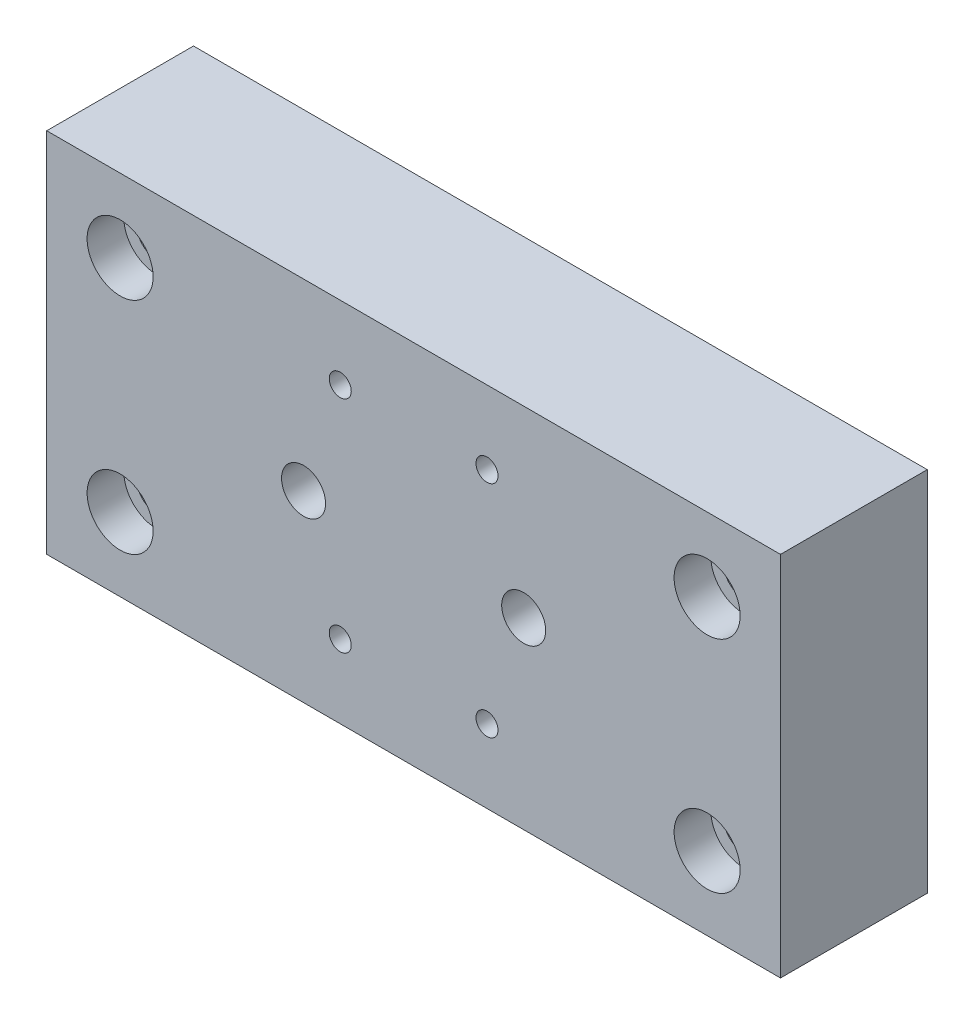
ISO-10303-21;
HEADER;
FILE_DESCRIPTION(('STEP AP214'),'2;1');
FILE_NAME('part.step','',(''),(''),'','','');
FILE_SCHEMA(('AUTOMOTIVE_DESIGN { 1 0 10303 214 1 1 1 1 }'));
ENDSEC;
DATA;
#1=APPLICATION_CONTEXT('core data for automotive mechanical design processes');
#2=APPLICATION_PROTOCOL_DEFINITION('international standard','automotive_design',2000,#1);
#3=PRODUCT_CONTEXT('',#1,'mechanical');
#4=PRODUCT('Part','Part','',(#3));
#5=PRODUCT_RELATED_PRODUCT_CATEGORY('part','',(#4));
#6=PRODUCT_DEFINITION_FORMATION('','',#4);
#7=PRODUCT_DEFINITION_CONTEXT('part definition',#1,'design');
#8=PRODUCT_DEFINITION('design','',#6,#7);
#9=PRODUCT_DEFINITION_SHAPE('','',#8);
#10=(LENGTH_UNIT() NAMED_UNIT(*) SI_UNIT(.MILLI.,.METRE.));
#11=(NAMED_UNIT(*) PLANE_ANGLE_UNIT() SI_UNIT($,.RADIAN.));
#12=(NAMED_UNIT(*) SI_UNIT($,.STERADIAN.) SOLID_ANGLE_UNIT());
#13=UNCERTAINTY_MEASURE_WITH_UNIT(LENGTH_MEASURE(1.E-05),#10,'distance_accuracy_value','');
#14=(GEOMETRIC_REPRESENTATION_CONTEXT(3) GLOBAL_UNCERTAINTY_ASSIGNED_CONTEXT((#13)) GLOBAL_UNIT_ASSIGNED_CONTEXT((#10,
#11,#12)) REPRESENTATION_CONTEXT('',''));
#15=CARTESIAN_POINT('',(0.,0.,0.));
#16=DIRECTION('',(0.,0.,1.));
#17=DIRECTION('',(1.,0.,0.));
#18=AXIS2_PLACEMENT_3D('',#15,#16,#17);
#19=CARTESIAN_POINT('',(-100.,50.,40.));
#20=DIRECTION('',(1.,0.,0.));
#21=DIRECTION('',(0.,0.,-1.));
#22=AXIS2_PLACEMENT_3D('',#19,#20,#21);
#23=PLANE('',#22);
#24=DIRECTION('',(0.,-1.,0.));
#25=VECTOR('',#24,1.);
#26=CARTESIAN_POINT('',(-100.,50.,0.));
#27=LINE('',#26,#25);
#28=CARTESIAN_POINT('',(-100.,50.,0.));
#29=VERTEX_POINT('',#28);
#30=CARTESIAN_POINT('',(-100.,-50.,0.));
#31=VERTEX_POINT('',#30);
#32=EDGE_CURVE('E508',#29,#31,#27,.T.);
#33=ORIENTED_EDGE('',*,*,#32,.T.);
#34=DIRECTION('',(0.,0.,-1.));
#35=VECTOR('',#34,1.);
#36=CARTESIAN_POINT('',(-100.,-50.,40.));
#37=LINE('',#36,#35);
#38=CARTESIAN_POINT('',(-100.,-50.,40.));
#39=VERTEX_POINT('',#38);
#40=EDGE_CURVE('E11',#39,#31,#37,.T.);
#41=ORIENTED_EDGE('',*,*,#40,.F.);
#42=DIRECTION('',(0.,-1.,0.));
#43=VECTOR('',#42,1.);
#44=CARTESIAN_POINT('',(-100.,50.,40.));
#45=LINE('',#44,#43);
#46=CARTESIAN_POINT('',(-100.,50.,40.));
#47=VERTEX_POINT('',#46);
#48=EDGE_CURVE('E517',#47,#39,#45,.T.);
#49=ORIENTED_EDGE('',*,*,#48,.F.);
#50=DIRECTION('',(0.,0.,-1.));
#51=VECTOR('',#50,1.);
#52=CARTESIAN_POINT('',(-100.,50.,40.));
#53=LINE('',#52,#51);
#54=EDGE_CURVE('E523',#47,#29,#53,.T.);
#55=ORIENTED_EDGE('',*,*,#54,.T.);
#56=EDGE_LOOP('',(#33,#41,#49,#55));
#57=FACE_BOUND('',#56,.T.);
#58=ADVANCED_FACE('F348',(#57),#23,.F.);
#59=CARTESIAN_POINT('',(-100.,-50.,40.));
#60=DIRECTION('',(0.,1.,0.));
#61=DIRECTION('',(0.,0.,1.));
#62=AXIS2_PLACEMENT_3D('',#59,#60,#61);
#63=PLANE('',#62);
#64=DIRECTION('',(1.,0.,0.));
#65=VECTOR('',#64,1.);
#66=CARTESIAN_POINT('',(-100.,-50.,0.));
#67=LINE('',#66,#65);
#68=CARTESIAN_POINT('',(100.,-50.,0.));
#69=VERTEX_POINT('',#68);
#70=EDGE_CURVE('E511',#31,#69,#67,.T.);
#71=ORIENTED_EDGE('',*,*,#70,.T.);
#72=DIRECTION('',(0.,0.,-1.));
#73=VECTOR('',#72,1.);
#74=CARTESIAN_POINT('',(100.,-50.,40.));
#75=LINE('',#74,#73);
#76=CARTESIAN_POINT('',(100.,-50.,40.));
#77=VERTEX_POINT('',#76);
#78=EDGE_CURVE('E355',#77,#69,#75,.T.);
#79=ORIENTED_EDGE('',*,*,#78,.F.);
#80=DIRECTION('',(1.,0.,0.));
#81=VECTOR('',#80,1.);
#82=CARTESIAN_POINT('',(-100.,-50.,40.));
#83=LINE('',#82,#81);
#84=EDGE_CURVE('E519',#39,#77,#83,.T.);
#85=ORIENTED_EDGE('',*,*,#84,.F.);
#86=ORIENTED_EDGE('',*,*,#40,.T.);
#87=EDGE_LOOP('',(#71,#79,#85,#86));
#88=FACE_BOUND('',#87,.T.);
#89=ADVANCED_FACE('F544',(#88),#63,.F.);
#90=CARTESIAN_POINT('',(100.,50.,40.));
#91=DIRECTION('',(-1.,0.,0.));
#92=DIRECTION('',(0.,-1.,0.));
#93=AXIS2_PLACEMENT_3D('',#90,#91,#92);
#94=PLANE('',#93);
#95=DIRECTION('',(0.,1.,0.));
#96=VECTOR('',#95,1.);
#97=CARTESIAN_POINT('',(100.,50.,0.));
#98=LINE('',#97,#96);
#99=CARTESIAN_POINT('',(100.,50.,0.));
#100=VERTEX_POINT('',#99);
#101=EDGE_CURVE('E513',#69,#100,#98,.T.);
#102=ORIENTED_EDGE('',*,*,#101,.T.);
#103=DIRECTION('',(0.,0.,-1.));
#104=VECTOR('',#103,1.);
#105=CARTESIAN_POINT('',(100.,50.,40.));
#106=LINE('',#105,#104);
#107=CARTESIAN_POINT('',(100.,50.,40.));
#108=VERTEX_POINT('',#107);
#109=EDGE_CURVE('E526',#108,#100,#106,.T.);
#110=ORIENTED_EDGE('',*,*,#109,.F.);
#111=DIRECTION('',(0.,1.,0.));
#112=VECTOR('',#111,1.);
#113=CARTESIAN_POINT('',(100.,50.,40.));
#114=LINE('',#113,#112);
#115=EDGE_CURVE('E367',#77,#108,#114,.T.);
#116=ORIENTED_EDGE('',*,*,#115,.F.);
#117=ORIENTED_EDGE('',*,*,#78,.T.);
#118=EDGE_LOOP('',(#102,#110,#116,#117));
#119=FACE_BOUND('',#118,.T.);
#120=ADVANCED_FACE('F532',(#119),#94,.F.);
#121=CARTESIAN_POINT('',(-100.,50.,40.));
#122=DIRECTION('',(0.,-1.,0.));
#123=DIRECTION('',(1.,0.,0.));
#124=AXIS2_PLACEMENT_3D('',#121,#122,#123);
#125=PLANE('',#124);
#126=DIRECTION('',(-1.,0.,0.));
#127=VECTOR('',#126,1.);
#128=CARTESIAN_POINT('',(-100.,50.,0.));
#129=LINE('',#128,#127);
#130=EDGE_CURVE('E515',#100,#29,#129,.T.);
#131=ORIENTED_EDGE('',*,*,#130,.T.);
#132=ORIENTED_EDGE('',*,*,#54,.F.);
#133=DIRECTION('',(-1.,0.,0.));
#134=VECTOR('',#133,1.);
#135=CARTESIAN_POINT('',(-100.,50.,40.));
#136=LINE('',#135,#134);
#137=EDGE_CURVE('E362',#108,#47,#136,.T.);
#138=ORIENTED_EDGE('',*,*,#137,.F.);
#139=ORIENTED_EDGE('',*,*,#109,.T.);
#140=EDGE_LOOP('',(#131,#132,#138,#139));
#141=FACE_BOUND('',#140,.T.);
#142=ADVANCED_FACE('F539',(#141),#125,.F.);
#143=CARTESIAN_POINT('',(-100.,-50.,40.));
#144=DIRECTION('',(0.,0.,1.));
#145=DIRECTION('',(1.,0.,0.));
#146=AXIS2_PLACEMENT_3D('',#143,#144,#145);
#147=PLANE('',#146);
#148=CARTESIAN_POINT('',(-30.,0.,40.));
#149=DIRECTION('',(0.,0.,1.));
#150=DIRECTION('',(1.,0.,0.));
#151=AXIS2_PLACEMENT_3D('',#148,#149,#150);
#152=CIRCLE('',#151,6.00000000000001);
#153=CARTESIAN_POINT('',(-24.,0.,40.));
#154=VERTEX_POINT('',#153);
#155=EDGE_CURVE('E680',#154,#154,#152,.T.);
#156=ORIENTED_EDGE('',*,*,#155,.F.);
#157=EDGE_LOOP('',(#156));
#158=FACE_BOUND('',#157,.T.);
#159=CARTESIAN_POINT('',(30.,0.,40.));
#160=DIRECTION('',(0.,0.,1.));
#161=DIRECTION('',(1.,0.,0.));
#162=AXIS2_PLACEMENT_3D('',#159,#160,#161);
#163=CIRCLE('',#162,6.00000000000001);
#164=CARTESIAN_POINT('',(36.,0.,40.));
#165=VERTEX_POINT('',#164);
#166=EDGE_CURVE('E415',#165,#165,#163,.T.);
#167=ORIENTED_EDGE('',*,*,#166,.F.);
#168=EDGE_LOOP('',(#167));
#169=FACE_BOUND('',#168,.T.);
#170=CARTESIAN_POINT('',(-20.,30.,40.));
#171=DIRECTION('',(0.,0.,1.));
#172=DIRECTION('',(1.,0.,0.));
#173=AXIS2_PLACEMENT_3D('',#170,#171,#172);
#174=CIRCLE('',#173,3.);
#175=CARTESIAN_POINT('',(-17.,30.,40.));
#176=VERTEX_POINT('',#175);
#177=EDGE_CURVE('E421',#176,#176,#174,.T.);
#178=ORIENTED_EDGE('',*,*,#177,.F.);
#179=EDGE_LOOP('',(#178));
#180=FACE_BOUND('',#179,.T.);
#181=CARTESIAN_POINT('',(20.,30.,40.));
#182=DIRECTION('',(0.,0.,1.));
#183=DIRECTION('',(1.,0.,0.));
#184=AXIS2_PLACEMENT_3D('',#181,#182,#183);
#185=CIRCLE('',#184,3.);
#186=CARTESIAN_POINT('',(23.,30.,40.));
#187=VERTEX_POINT('',#186);
#188=EDGE_CURVE('E433',#187,#187,#185,.T.);
#189=ORIENTED_EDGE('',*,*,#188,.F.);
#190=EDGE_LOOP('',(#189));
#191=FACE_BOUND('',#190,.T.);
#192=CARTESIAN_POINT('',(-20.,-30.,40.));
#193=DIRECTION('',(0.,0.,1.));
#194=DIRECTION('',(1.,0.,0.));
#195=AXIS2_PLACEMENT_3D('',#192,#193,#194);
#196=CIRCLE('',#195,3.);
#197=CARTESIAN_POINT('',(-17.,-30.,40.));
#198=VERTEX_POINT('',#197);
#199=EDGE_CURVE('E445',#198,#198,#196,.T.);
#200=ORIENTED_EDGE('',*,*,#199,.F.);
#201=EDGE_LOOP('',(#200));
#202=FACE_BOUND('',#201,.T.);
#203=CARTESIAN_POINT('',(20.,-30.,40.));
#204=DIRECTION('',(0.,0.,1.));
#205=DIRECTION('',(1.,0.,0.));
#206=AXIS2_PLACEMENT_3D('',#203,#204,#205);
#207=CIRCLE('',#206,3.);
#208=CARTESIAN_POINT('',(23.,-30.,40.));
#209=VERTEX_POINT('',#208);
#210=EDGE_CURVE('E457',#209,#209,#207,.T.);
#211=ORIENTED_EDGE('',*,*,#210,.F.);
#212=EDGE_LOOP('',(#211));
#213=FACE_BOUND('',#212,.T.);
#214=CARTESIAN_POINT('',(-80.,30.,40.));
#215=DIRECTION('',(0.,0.,1.));
#216=DIRECTION('',(1.,0.,0.));
#217=AXIS2_PLACEMENT_3D('',#214,#215,#216);
#218=CIRCLE('',#217,8.99999999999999);
#219=CARTESIAN_POINT('',(-71.,30.,40.));
#220=VERTEX_POINT('',#219);
#221=EDGE_CURVE('E466',#220,#220,#218,.T.);
#222=ORIENTED_EDGE('',*,*,#221,.F.);
#223=EDGE_LOOP('',(#222));
#224=FACE_BOUND('',#223,.T.);
#225=CARTESIAN_POINT('',(-80.,-30.,40.));
#226=DIRECTION('',(0.,0.,1.));
#227=DIRECTION('',(1.,0.,0.));
#228=AXIS2_PLACEMENT_3D('',#225,#226,#227);
#229=CIRCLE('',#228,8.99999999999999);
#230=CARTESIAN_POINT('',(-71.,-30.,40.));
#231=VERTEX_POINT('',#230);
#232=EDGE_CURVE('E478',#231,#231,#229,.T.);
#233=ORIENTED_EDGE('',*,*,#232,.F.);
#234=EDGE_LOOP('',(#233));
#235=FACE_BOUND('',#234,.T.);
#236=CARTESIAN_POINT('',(80.,30.,40.));
#237=DIRECTION('',(0.,0.,1.));
#238=DIRECTION('',(1.,0.,0.));
#239=AXIS2_PLACEMENT_3D('',#236,#237,#238);
#240=CIRCLE('',#239,8.99999999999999);
#241=CARTESIAN_POINT('',(89.,30.,40.));
#242=VERTEX_POINT('',#241);
#243=EDGE_CURVE('E490',#242,#242,#240,.T.);
#244=ORIENTED_EDGE('',*,*,#243,.F.);
#245=EDGE_LOOP('',(#244));
#246=FACE_BOUND('',#245,.T.);
#247=CARTESIAN_POINT('',(80.,-30.,40.));
#248=DIRECTION('',(0.,0.,1.));
#249=DIRECTION('',(1.,0.,0.));
#250=AXIS2_PLACEMENT_3D('',#247,#248,#249);
#251=CIRCLE('',#250,9.00000000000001);
#252=CARTESIAN_POINT('',(89.,-30.,40.));
#253=VERTEX_POINT('',#252);
#254=EDGE_CURVE('E502',#253,#253,#251,.T.);
#255=ORIENTED_EDGE('',*,*,#254,.F.);
#256=EDGE_LOOP('',(#255));
#257=FACE_BOUND('',#256,.T.);
#258=ORIENTED_EDGE('',*,*,#48,.T.);
#259=ORIENTED_EDGE('',*,*,#84,.T.);
#260=ORIENTED_EDGE('',*,*,#115,.T.);
#261=ORIENTED_EDGE('',*,*,#137,.T.);
#262=EDGE_LOOP('',(#258,#259,#260,#261));
#263=FACE_BOUND('',#262,.T.);
#264=ADVANCED_FACE('F543',(#158,#169,#180,#191,#202,#213,#224,#235,#246,#257,#263),#147,.T.);
#265=CARTESIAN_POINT('',(-100.,-50.,0.));
#266=DIRECTION('',(0.,0.,1.));
#267=DIRECTION('',(1.,0.,0.));
#268=AXIS2_PLACEMENT_3D('',#265,#266,#267);
#269=PLANE('',#268);
#270=CARTESIAN_POINT('',(-30.,0.,0.));
#271=DIRECTION('',(0.,0.,1.));
#272=DIRECTION('',(1.,0.,0.));
#273=AXIS2_PLACEMENT_3D('',#270,#271,#272);
#274=CIRCLE('',#273,6.00000000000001);
#275=CARTESIAN_POINT('',(-24.,0.,0.));
#276=VERTEX_POINT('',#275);
#277=EDGE_CURVE('E677',#276,#276,#274,.T.);
#278=ORIENTED_EDGE('',*,*,#277,.T.);
#279=EDGE_LOOP('',(#278));
#280=FACE_BOUND('',#279,.T.);
#281=CARTESIAN_POINT('',(30.,0.,0.));
#282=DIRECTION('',(0.,0.,1.));
#283=DIRECTION('',(1.,0.,0.));
#284=AXIS2_PLACEMENT_3D('',#281,#282,#283);
#285=CIRCLE('',#284,6.00000000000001);
#286=CARTESIAN_POINT('',(36.,0.,0.));
#287=VERTEX_POINT('',#286);
#288=EDGE_CURVE('E409',#287,#287,#285,.T.);
#289=ORIENTED_EDGE('',*,*,#288,.T.);
#290=EDGE_LOOP('',(#289));
#291=FACE_BOUND('',#290,.T.);
#292=CARTESIAN_POINT('',(-80.,30.,0.));
#293=DIRECTION('',(0.,0.,1.));
#294=DIRECTION('',(1.,0.,0.));
#295=AXIS2_PLACEMENT_3D('',#292,#293,#294);
#296=CIRCLE('',#295,5.5);
#297=CARTESIAN_POINT('',(-74.5,30.,0.));
#298=VERTEX_POINT('',#297);
#299=EDGE_CURVE('E469',#298,#298,#296,.T.);
#300=ORIENTED_EDGE('',*,*,#299,.T.);
#301=EDGE_LOOP('',(#300));
#302=FACE_BOUND('',#301,.T.);
#303=CARTESIAN_POINT('',(-80.,-30.,0.));
#304=DIRECTION('',(0.,0.,1.));
#305=DIRECTION('',(1.,0.,0.));
#306=AXIS2_PLACEMENT_3D('',#303,#304,#305);
#307=CIRCLE('',#306,5.5);
#308=CARTESIAN_POINT('',(-74.5,-30.,0.));
#309=VERTEX_POINT('',#308);
#310=EDGE_CURVE('E481',#309,#309,#307,.T.);
#311=ORIENTED_EDGE('',*,*,#310,.T.);
#312=EDGE_LOOP('',(#311));
#313=FACE_BOUND('',#312,.T.);
#314=CARTESIAN_POINT('',(80.,30.,0.));
#315=DIRECTION('',(0.,0.,1.));
#316=DIRECTION('',(1.,0.,0.));
#317=AXIS2_PLACEMENT_3D('',#314,#315,#316);
#318=CIRCLE('',#317,5.5);
#319=CARTESIAN_POINT('',(85.5,30.,0.));
#320=VERTEX_POINT('',#319);
#321=EDGE_CURVE('E493',#320,#320,#318,.T.);
#322=ORIENTED_EDGE('',*,*,#321,.T.);
#323=EDGE_LOOP('',(#322));
#324=FACE_BOUND('',#323,.T.);
#325=CARTESIAN_POINT('',(80.,-30.,0.));
#326=DIRECTION('',(0.,0.,1.));
#327=DIRECTION('',(1.,0.,0.));
#328=AXIS2_PLACEMENT_3D('',#325,#326,#327);
#329=CIRCLE('',#328,5.5);
#330=CARTESIAN_POINT('',(85.5,-30.,0.));
#331=VERTEX_POINT('',#330);
#332=EDGE_CURVE('E505',#331,#331,#329,.T.);
#333=ORIENTED_EDGE('',*,*,#332,.T.);
#334=EDGE_LOOP('',(#333));
#335=FACE_BOUND('',#334,.T.);
#336=ORIENTED_EDGE('',*,*,#32,.F.);
#337=ORIENTED_EDGE('',*,*,#130,.F.);
#338=ORIENTED_EDGE('',*,*,#101,.F.);
#339=ORIENTED_EDGE('',*,*,#70,.F.);
#340=EDGE_LOOP('',(#336,#337,#338,#339));
#341=FACE_BOUND('',#340,.T.);
#342=ADVANCED_FACE('F537',(#280,#291,#302,#313,#324,#335,#341),#269,.F.);
#343=CARTESIAN_POINT('',(80.,-30.,40.));
#344=DIRECTION('',(0.,0.,1.));
#345=DIRECTION('',(1.,0.,0.));
#346=AXIS2_PLACEMENT_3D('',#343,#344,#345);
#347=CYLINDRICAL_SURFACE('',#346,9.00000000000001);
#348=CARTESIAN_POINT('',(80.,-30.,30.));
#349=DIRECTION('',(0.,0.,1.));
#350=DIRECTION('',(1.,0.,0.));
#351=AXIS2_PLACEMENT_3D('',#348,#349,#350);
#352=CIRCLE('',#351,9.00000000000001);
#353=CARTESIAN_POINT('',(89.,-30.,30.));
#354=VERTEX_POINT('',#353);
#355=EDGE_CURVE('E499',#354,#354,#352,.T.);
#356=ORIENTED_EDGE('',*,*,#355,.F.);
#357=EDGE_LOOP('',(#356));
#358=FACE_BOUND('',#357,.T.);
#359=ORIENTED_EDGE('',*,*,#254,.T.);
#360=EDGE_LOOP('',(#359));
#361=FACE_BOUND('',#360,.T.);
#362=ADVANCED_FACE('F559',(#358,#361),#347,.F.);
#363=CARTESIAN_POINT('',(85.5,-30.,30.));
#364=DIRECTION('',(0.,0.,-1.));
#365=DIRECTION('',(-1.,0.,0.));
#366=AXIS2_PLACEMENT_3D('',#363,#364,#365);
#367=PLANE('',#366);
#368=CARTESIAN_POINT('',(80.,-30.,30.));
#369=DIRECTION('',(0.,0.,1.));
#370=DIRECTION('',(1.,0.,0.));
#371=AXIS2_PLACEMENT_3D('',#368,#369,#370);
#372=CIRCLE('',#371,5.50000000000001);
#373=CARTESIAN_POINT('',(85.5,-30.,30.));
#374=VERTEX_POINT('',#373);
#375=EDGE_CURVE('E496',#374,#374,#372,.T.);
#376=ORIENTED_EDGE('',*,*,#375,.F.);
#377=EDGE_LOOP('',(#376));
#378=FACE_BOUND('',#377,.T.);
#379=ORIENTED_EDGE('',*,*,#355,.T.);
#380=EDGE_LOOP('',(#379));
#381=FACE_BOUND('',#380,.T.);
#382=ADVANCED_FACE('F563',(#378,#381),#367,.F.);
#383=CARTESIAN_POINT('',(80.,-30.,40.));
#384=DIRECTION('',(0.,0.,1.));
#385=DIRECTION('',(1.,0.,0.));
#386=AXIS2_PLACEMENT_3D('',#383,#384,#385);
#387=CYLINDRICAL_SURFACE('',#386,5.5);
#388=ORIENTED_EDGE('',*,*,#332,.F.);
#389=EDGE_LOOP('',(#388));
#390=FACE_BOUND('',#389,.T.);
#391=ORIENTED_EDGE('',*,*,#375,.T.);
#392=EDGE_LOOP('',(#391));
#393=FACE_BOUND('',#392,.T.);
#394=ADVANCED_FACE('F567',(#390,#393),#387,.F.);
#395=CARTESIAN_POINT('',(80.,30.,40.));
#396=DIRECTION('',(0.,0.,1.));
#397=DIRECTION('',(1.,0.,0.));
#398=AXIS2_PLACEMENT_3D('',#395,#396,#397);
#399=CYLINDRICAL_SURFACE('',#398,8.99999999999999);
#400=CARTESIAN_POINT('',(80.,30.,30.));
#401=DIRECTION('',(0.,0.,1.));
#402=DIRECTION('',(1.,0.,0.));
#403=AXIS2_PLACEMENT_3D('',#400,#401,#402);
#404=CIRCLE('',#403,8.99999999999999);
#405=CARTESIAN_POINT('',(89.,30.,30.));
#406=VERTEX_POINT('',#405);
#407=EDGE_CURVE('E487',#406,#406,#404,.T.);
#408=ORIENTED_EDGE('',*,*,#407,.F.);
#409=EDGE_LOOP('',(#408));
#410=FACE_BOUND('',#409,.T.);
#411=ORIENTED_EDGE('',*,*,#243,.T.);
#412=EDGE_LOOP('',(#411));
#413=FACE_BOUND('',#412,.T.);
#414=ADVANCED_FACE('F571',(#410,#413),#399,.F.);
#415=CARTESIAN_POINT('',(85.5,30.,30.));
#416=DIRECTION('',(0.,0.,-1.));
#417=DIRECTION('',(-1.,0.,0.));
#418=AXIS2_PLACEMENT_3D('',#415,#416,#417);
#419=PLANE('',#418);
#420=CARTESIAN_POINT('',(80.,30.,30.));
#421=DIRECTION('',(0.,0.,1.));
#422=DIRECTION('',(1.,0.,0.));
#423=AXIS2_PLACEMENT_3D('',#420,#421,#422);
#424=CIRCLE('',#423,5.50000000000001);
#425=CARTESIAN_POINT('',(85.5,30.,30.));
#426=VERTEX_POINT('',#425);
#427=EDGE_CURVE('E484',#426,#426,#424,.T.);
#428=ORIENTED_EDGE('',*,*,#427,.F.);
#429=EDGE_LOOP('',(#428));
#430=FACE_BOUND('',#429,.T.);
#431=ORIENTED_EDGE('',*,*,#407,.T.);
#432=EDGE_LOOP('',(#431));
#433=FACE_BOUND('',#432,.T.);
#434=ADVANCED_FACE('F575',(#430,#433),#419,.F.);
#435=CARTESIAN_POINT('',(80.,30.,40.));
#436=DIRECTION('',(0.,0.,1.));
#437=DIRECTION('',(1.,0.,0.));
#438=AXIS2_PLACEMENT_3D('',#435,#436,#437);
#439=CYLINDRICAL_SURFACE('',#438,5.5);
#440=ORIENTED_EDGE('',*,*,#321,.F.);
#441=EDGE_LOOP('',(#440));
#442=FACE_BOUND('',#441,.T.);
#443=ORIENTED_EDGE('',*,*,#427,.T.);
#444=EDGE_LOOP('',(#443));
#445=FACE_BOUND('',#444,.T.);
#446=ADVANCED_FACE('F579',(#442,#445),#439,.F.);
#447=CARTESIAN_POINT('',(-80.,-30.,40.));
#448=DIRECTION('',(0.,0.,1.));
#449=DIRECTION('',(1.,0.,0.));
#450=AXIS2_PLACEMENT_3D('',#447,#448,#449);
#451=CYLINDRICAL_SURFACE('',#450,8.99999999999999);
#452=CARTESIAN_POINT('',(-80.,-30.,30.));
#453=DIRECTION('',(0.,0.,1.));
#454=DIRECTION('',(1.,0.,0.));
#455=AXIS2_PLACEMENT_3D('',#452,#453,#454);
#456=CIRCLE('',#455,8.99999999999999);
#457=CARTESIAN_POINT('',(-71.,-30.,30.));
#458=VERTEX_POINT('',#457);
#459=EDGE_CURVE('E475',#458,#458,#456,.T.);
#460=ORIENTED_EDGE('',*,*,#459,.F.);
#461=EDGE_LOOP('',(#460));
#462=FACE_BOUND('',#461,.T.);
#463=ORIENTED_EDGE('',*,*,#232,.T.);
#464=EDGE_LOOP('',(#463));
#465=FACE_BOUND('',#464,.T.);
#466=ADVANCED_FACE('F583',(#462,#465),#451,.F.);
#467=CARTESIAN_POINT('',(-74.5,-30.,30.));
#468=DIRECTION('',(0.,0.,-1.));
#469=DIRECTION('',(-1.,0.,0.));
#470=AXIS2_PLACEMENT_3D('',#467,#468,#469);
#471=PLANE('',#470);
#472=CARTESIAN_POINT('',(-80.,-30.,30.));
#473=DIRECTION('',(0.,0.,1.));
#474=DIRECTION('',(1.,0.,0.));
#475=AXIS2_PLACEMENT_3D('',#472,#473,#474);
#476=CIRCLE('',#475,5.50000000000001);
#477=CARTESIAN_POINT('',(-74.5,-30.,30.));
#478=VERTEX_POINT('',#477);
#479=EDGE_CURVE('E472',#478,#478,#476,.T.);
#480=ORIENTED_EDGE('',*,*,#479,.F.);
#481=EDGE_LOOP('',(#480));
#482=FACE_BOUND('',#481,.T.);
#483=ORIENTED_EDGE('',*,*,#459,.T.);
#484=EDGE_LOOP('',(#483));
#485=FACE_BOUND('',#484,.T.);
#486=ADVANCED_FACE('F587',(#482,#485),#471,.F.);
#487=CARTESIAN_POINT('',(-80.,-30.,40.));
#488=DIRECTION('',(0.,0.,1.));
#489=DIRECTION('',(1.,0.,0.));
#490=AXIS2_PLACEMENT_3D('',#487,#488,#489);
#491=CYLINDRICAL_SURFACE('',#490,5.5);
#492=ORIENTED_EDGE('',*,*,#310,.F.);
#493=EDGE_LOOP('',(#492));
#494=FACE_BOUND('',#493,.T.);
#495=ORIENTED_EDGE('',*,*,#479,.T.);
#496=EDGE_LOOP('',(#495));
#497=FACE_BOUND('',#496,.T.);
#498=ADVANCED_FACE('F591',(#494,#497),#491,.F.);
#499=CARTESIAN_POINT('',(-80.,30.,40.));
#500=DIRECTION('',(0.,0.,1.));
#501=DIRECTION('',(1.,0.,0.));
#502=AXIS2_PLACEMENT_3D('',#499,#500,#501);
#503=CYLINDRICAL_SURFACE('',#502,8.99999999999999);
#504=CARTESIAN_POINT('',(-80.,30.,30.));
#505=DIRECTION('',(0.,0.,1.));
#506=DIRECTION('',(1.,0.,0.));
#507=AXIS2_PLACEMENT_3D('',#504,#505,#506);
#508=CIRCLE('',#507,8.99999999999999);
#509=CARTESIAN_POINT('',(-71.,30.,30.));
#510=VERTEX_POINT('',#509);
#511=EDGE_CURVE('E463',#510,#510,#508,.T.);
#512=ORIENTED_EDGE('',*,*,#511,.F.);
#513=EDGE_LOOP('',(#512));
#514=FACE_BOUND('',#513,.T.);
#515=ORIENTED_EDGE('',*,*,#221,.T.);
#516=EDGE_LOOP('',(#515));
#517=FACE_BOUND('',#516,.T.);
#518=ADVANCED_FACE('F595',(#514,#517),#503,.F.);
#519=CARTESIAN_POINT('',(-74.5,30.,30.));
#520=DIRECTION('',(0.,0.,-1.));
#521=DIRECTION('',(-1.,0.,0.));
#522=AXIS2_PLACEMENT_3D('',#519,#520,#521);
#523=PLANE('',#522);
#524=CARTESIAN_POINT('',(-80.,30.,30.));
#525=DIRECTION('',(0.,0.,1.));
#526=DIRECTION('',(1.,0.,0.));
#527=AXIS2_PLACEMENT_3D('',#524,#525,#526);
#528=CIRCLE('',#527,5.50000000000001);
#529=CARTESIAN_POINT('',(-74.5,30.,30.));
#530=VERTEX_POINT('',#529);
#531=EDGE_CURVE('E460',#530,#530,#528,.T.);
#532=ORIENTED_EDGE('',*,*,#531,.F.);
#533=EDGE_LOOP('',(#532));
#534=FACE_BOUND('',#533,.T.);
#535=ORIENTED_EDGE('',*,*,#511,.T.);
#536=EDGE_LOOP('',(#535));
#537=FACE_BOUND('',#536,.T.);
#538=ADVANCED_FACE('F599',(#534,#537),#523,.F.);
#539=CARTESIAN_POINT('',(-80.,30.,40.));
#540=DIRECTION('',(0.,0.,1.));
#541=DIRECTION('',(1.,0.,0.));
#542=AXIS2_PLACEMENT_3D('',#539,#540,#541);
#543=CYLINDRICAL_SURFACE('',#542,5.5);
#544=ORIENTED_EDGE('',*,*,#299,.F.);
#545=EDGE_LOOP('',(#544));
#546=FACE_BOUND('',#545,.T.);
#547=ORIENTED_EDGE('',*,*,#531,.T.);
#548=EDGE_LOOP('',(#547));
#549=FACE_BOUND('',#548,.T.);
#550=ADVANCED_FACE('F603',(#546,#549),#543,.F.);
#551=CARTESIAN_POINT('',(20.,-30.,40.));
#552=DIRECTION('',(0.,0.,1.));
#553=DIRECTION('',(1.,0.,0.));
#554=AXIS2_PLACEMENT_3D('',#551,#552,#553);
#555=CYLINDRICAL_SURFACE('',#554,3.);
#556=CARTESIAN_POINT('',(20.,-30.,20.));
#557=DIRECTION('',(0.,0.,1.));
#558=DIRECTION('',(1.,0.,0.));
#559=AXIS2_PLACEMENT_3D('',#556,#557,#558);
#560=CIRCLE('',#559,3.);
#561=CARTESIAN_POINT('',(23.,-30.,20.));
#562=VERTEX_POINT('',#561);
#563=EDGE_CURVE('E454',#562,#562,#560,.T.);
#564=ORIENTED_EDGE('',*,*,#563,.F.);
#565=EDGE_LOOP('',(#564));
#566=FACE_BOUND('',#565,.T.);
#567=ORIENTED_EDGE('',*,*,#210,.T.);
#568=EDGE_LOOP('',(#567));
#569=FACE_BOUND('',#568,.T.);
#570=ADVANCED_FACE('F607',(#566,#569),#555,.F.);
#571=CARTESIAN_POINT('',(22.5,-30.,20.));
#572=DIRECTION('',(0.,0.,-1.));
#573=DIRECTION('',(-1.,0.,0.));
#574=AXIS2_PLACEMENT_3D('',#571,#572,#573);
#575=PLANE('',#574);
#576=CARTESIAN_POINT('',(20.,-30.,20.));
#577=DIRECTION('',(0.,0.,1.));
#578=DIRECTION('',(1.,0.,0.));
#579=AXIS2_PLACEMENT_3D('',#576,#577,#578);
#580=CIRCLE('',#579,2.5);
#581=CARTESIAN_POINT('',(22.5,-30.,20.));
#582=VERTEX_POINT('',#581);
#583=EDGE_CURVE('E451',#582,#582,#580,.T.);
#584=ORIENTED_EDGE('',*,*,#583,.F.);
#585=EDGE_LOOP('',(#584));
#586=FACE_BOUND('',#585,.T.);
#587=ORIENTED_EDGE('',*,*,#563,.T.);
#588=EDGE_LOOP('',(#587));
#589=FACE_BOUND('',#588,.T.);
#590=ADVANCED_FACE('F611',(#586,#589),#575,.F.);
#591=CARTESIAN_POINT('',(20.,-30.,40.));
#592=DIRECTION('',(0.,0.,1.));
#593=DIRECTION('',(1.,0.,0.));
#594=AXIS2_PLACEMENT_3D('',#591,#592,#593);
#595=CYLINDRICAL_SURFACE('',#594,2.5);
#596=CARTESIAN_POINT('',(20.,-30.,15.));
#597=DIRECTION('',(0.,0.,1.));
#598=DIRECTION('',(1.,0.,0.));
#599=AXIS2_PLACEMENT_3D('',#596,#597,#598);
#600=CIRCLE('',#599,2.5);
#601=CARTESIAN_POINT('',(22.5,-30.,15.));
#602=VERTEX_POINT('',#601);
#603=EDGE_CURVE('E448',#602,#602,#600,.T.);
#604=ORIENTED_EDGE('',*,*,#603,.F.);
#605=EDGE_LOOP('',(#604));
#606=FACE_BOUND('',#605,.T.);
#607=ORIENTED_EDGE('',*,*,#583,.T.);
#608=EDGE_LOOP('',(#607));
#609=FACE_BOUND('',#608,.T.);
#610=ADVANCED_FACE('F615',(#606,#609),#595,.F.);
#611=CARTESIAN_POINT('',(20.,-30.,15.));
#612=DIRECTION('',(0.,0.,1.));
#613=DIRECTION('',(1.,0.,0.));
#614=AXIS2_PLACEMENT_3D('',#611,#612,#613);
#615=CONICAL_SURFACE('',#614,2.5,1.02974425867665);
#616=CARTESIAN_POINT('',(20.,-30.,13.4978484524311));
#617=VERTEX_POINT('',#616);
#618=VERTEX_LOOP('',#617);
#619=FACE_BOUND('',#618,.T.);
#620=ORIENTED_EDGE('',*,*,#603,.T.);
#621=EDGE_LOOP('',(#620));
#622=FACE_BOUND('',#621,.T.);
#623=ADVANCED_FACE('F619',(#619,#622),#615,.F.);
#624=CARTESIAN_POINT('',(-20.,-30.,40.));
#625=DIRECTION('',(0.,0.,1.));
#626=DIRECTION('',(1.,0.,0.));
#627=AXIS2_PLACEMENT_3D('',#624,#625,#626);
#628=CYLINDRICAL_SURFACE('',#627,3.);
#629=CARTESIAN_POINT('',(-20.,-30.,20.));
#630=DIRECTION('',(0.,0.,1.));
#631=DIRECTION('',(1.,0.,0.));
#632=AXIS2_PLACEMENT_3D('',#629,#630,#631);
#633=CIRCLE('',#632,3.);
#634=CARTESIAN_POINT('',(-17.,-30.,20.));
#635=VERTEX_POINT('',#634);
#636=EDGE_CURVE('E442',#635,#635,#633,.T.);
#637=ORIENTED_EDGE('',*,*,#636,.F.);
#638=EDGE_LOOP('',(#637));
#639=FACE_BOUND('',#638,.T.);
#640=ORIENTED_EDGE('',*,*,#199,.T.);
#641=EDGE_LOOP('',(#640));
#642=FACE_BOUND('',#641,.T.);
#643=ADVANCED_FACE('F623',(#639,#642),#628,.F.);
#644=CARTESIAN_POINT('',(-17.5,-30.,20.));
#645=DIRECTION('',(0.,0.,-1.));
#646=DIRECTION('',(-1.,0.,0.));
#647=AXIS2_PLACEMENT_3D('',#644,#645,#646);
#648=PLANE('',#647);
#649=CARTESIAN_POINT('',(-20.,-30.,20.));
#650=DIRECTION('',(0.,0.,1.));
#651=DIRECTION('',(1.,0.,0.));
#652=AXIS2_PLACEMENT_3D('',#649,#650,#651);
#653=CIRCLE('',#652,2.5);
#654=CARTESIAN_POINT('',(-17.5,-30.,20.));
#655=VERTEX_POINT('',#654);
#656=EDGE_CURVE('E439',#655,#655,#653,.T.);
#657=ORIENTED_EDGE('',*,*,#656,.F.);
#658=EDGE_LOOP('',(#657));
#659=FACE_BOUND('',#658,.T.);
#660=ORIENTED_EDGE('',*,*,#636,.T.);
#661=EDGE_LOOP('',(#660));
#662=FACE_BOUND('',#661,.T.);
#663=ADVANCED_FACE('F627',(#659,#662),#648,.F.);
#664=CARTESIAN_POINT('',(-20.,-30.,40.));
#665=DIRECTION('',(0.,0.,1.));
#666=DIRECTION('',(1.,0.,0.));
#667=AXIS2_PLACEMENT_3D('',#664,#665,#666);
#668=CYLINDRICAL_SURFACE('',#667,2.5);
#669=CARTESIAN_POINT('',(-20.,-30.,15.));
#670=DIRECTION('',(0.,0.,1.));
#671=DIRECTION('',(1.,0.,0.));
#672=AXIS2_PLACEMENT_3D('',#669,#670,#671);
#673=CIRCLE('',#672,2.5);
#674=CARTESIAN_POINT('',(-17.5,-30.,15.));
#675=VERTEX_POINT('',#674);
#676=EDGE_CURVE('E436',#675,#675,#673,.T.);
#677=ORIENTED_EDGE('',*,*,#676,.F.);
#678=EDGE_LOOP('',(#677));
#679=FACE_BOUND('',#678,.T.);
#680=ORIENTED_EDGE('',*,*,#656,.T.);
#681=EDGE_LOOP('',(#680));
#682=FACE_BOUND('',#681,.T.);
#683=ADVANCED_FACE('F631',(#679,#682),#668,.F.);
#684=CARTESIAN_POINT('',(-20.,-30.,15.));
#685=DIRECTION('',(0.,0.,1.));
#686=DIRECTION('',(1.,0.,0.));
#687=AXIS2_PLACEMENT_3D('',#684,#685,#686);
#688=CONICAL_SURFACE('',#687,2.5,1.02974425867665);
#689=CARTESIAN_POINT('',(-20.,-30.,13.4978484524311));
#690=VERTEX_POINT('',#689);
#691=VERTEX_LOOP('',#690);
#692=FACE_BOUND('',#691,.T.);
#693=ORIENTED_EDGE('',*,*,#676,.T.);
#694=EDGE_LOOP('',(#693));
#695=FACE_BOUND('',#694,.T.);
#696=ADVANCED_FACE('F635',(#692,#695),#688,.F.);
#697=CARTESIAN_POINT('',(20.,30.,40.));
#698=DIRECTION('',(0.,0.,1.));
#699=DIRECTION('',(1.,0.,0.));
#700=AXIS2_PLACEMENT_3D('',#697,#698,#699);
#701=CYLINDRICAL_SURFACE('',#700,3.);
#702=CARTESIAN_POINT('',(20.,30.,20.));
#703=DIRECTION('',(0.,0.,1.));
#704=DIRECTION('',(1.,0.,0.));
#705=AXIS2_PLACEMENT_3D('',#702,#703,#704);
#706=CIRCLE('',#705,3.);
#707=CARTESIAN_POINT('',(23.,30.,20.));
#708=VERTEX_POINT('',#707);
#709=EDGE_CURVE('E430',#708,#708,#706,.T.);
#710=ORIENTED_EDGE('',*,*,#709,.F.);
#711=EDGE_LOOP('',(#710));
#712=FACE_BOUND('',#711,.T.);
#713=ORIENTED_EDGE('',*,*,#188,.T.);
#714=EDGE_LOOP('',(#713));
#715=FACE_BOUND('',#714,.T.);
#716=ADVANCED_FACE('F639',(#712,#715),#701,.F.);
#717=CARTESIAN_POINT('',(22.5,30.,20.));
#718=DIRECTION('',(0.,0.,-1.));
#719=DIRECTION('',(-1.,0.,0.));
#720=AXIS2_PLACEMENT_3D('',#717,#718,#719);
#721=PLANE('',#720);
#722=CARTESIAN_POINT('',(20.,30.,20.));
#723=DIRECTION('',(0.,0.,1.));
#724=DIRECTION('',(1.,0.,0.));
#725=AXIS2_PLACEMENT_3D('',#722,#723,#724);
#726=CIRCLE('',#725,2.5);
#727=CARTESIAN_POINT('',(22.5,30.,20.));
#728=VERTEX_POINT('',#727);
#729=EDGE_CURVE('E427',#728,#728,#726,.T.);
#730=ORIENTED_EDGE('',*,*,#729,.F.);
#731=EDGE_LOOP('',(#730));
#732=FACE_BOUND('',#731,.T.);
#733=ORIENTED_EDGE('',*,*,#709,.T.);
#734=EDGE_LOOP('',(#733));
#735=FACE_BOUND('',#734,.T.);
#736=ADVANCED_FACE('F643',(#732,#735),#721,.F.);
#737=CARTESIAN_POINT('',(20.,30.,40.));
#738=DIRECTION('',(0.,0.,1.));
#739=DIRECTION('',(1.,0.,0.));
#740=AXIS2_PLACEMENT_3D('',#737,#738,#739);
#741=CYLINDRICAL_SURFACE('',#740,2.5);
#742=CARTESIAN_POINT('',(20.,30.,15.));
#743=DIRECTION('',(0.,0.,1.));
#744=DIRECTION('',(1.,0.,0.));
#745=AXIS2_PLACEMENT_3D('',#742,#743,#744);
#746=CIRCLE('',#745,2.5);
#747=CARTESIAN_POINT('',(22.5,30.,15.));
#748=VERTEX_POINT('',#747);
#749=EDGE_CURVE('E424',#748,#748,#746,.T.);
#750=ORIENTED_EDGE('',*,*,#749,.F.);
#751=EDGE_LOOP('',(#750));
#752=FACE_BOUND('',#751,.T.);
#753=ORIENTED_EDGE('',*,*,#729,.T.);
#754=EDGE_LOOP('',(#753));
#755=FACE_BOUND('',#754,.T.);
#756=ADVANCED_FACE('F647',(#752,#755),#741,.F.);
#757=CARTESIAN_POINT('',(20.,30.,15.));
#758=DIRECTION('',(0.,0.,1.));
#759=DIRECTION('',(1.,0.,0.));
#760=AXIS2_PLACEMENT_3D('',#757,#758,#759);
#761=CONICAL_SURFACE('',#760,2.5,1.02974425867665);
#762=CARTESIAN_POINT('',(20.,30.,13.4978484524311));
#763=VERTEX_POINT('',#762);
#764=VERTEX_LOOP('',#763);
#765=FACE_BOUND('',#764,.T.);
#766=ORIENTED_EDGE('',*,*,#749,.T.);
#767=EDGE_LOOP('',(#766));
#768=FACE_BOUND('',#767,.T.);
#769=ADVANCED_FACE('F651',(#765,#768),#761,.F.);
#770=CARTESIAN_POINT('',(-20.,30.,40.));
#771=DIRECTION('',(0.,0.,1.));
#772=DIRECTION('',(1.,0.,0.));
#773=AXIS2_PLACEMENT_3D('',#770,#771,#772);
#774=CYLINDRICAL_SURFACE('',#773,3.);
#775=CARTESIAN_POINT('',(-20.,30.,20.));
#776=DIRECTION('',(0.,0.,1.));
#777=DIRECTION('',(1.,0.,0.));
#778=AXIS2_PLACEMENT_3D('',#775,#776,#777);
#779=CIRCLE('',#778,3.);
#780=CARTESIAN_POINT('',(-17.,30.,20.));
#781=VERTEX_POINT('',#780);
#782=EDGE_CURVE('E412',#781,#781,#779,.T.);
#783=ORIENTED_EDGE('',*,*,#782,.F.);
#784=EDGE_LOOP('',(#783));
#785=FACE_BOUND('',#784,.T.);
#786=ORIENTED_EDGE('',*,*,#177,.T.);
#787=EDGE_LOOP('',(#786));
#788=FACE_BOUND('',#787,.T.);
#789=ADVANCED_FACE('F655',(#785,#788),#774,.F.);
#790=CARTESIAN_POINT('',(-17.5,30.,20.));
#791=DIRECTION('',(0.,0.,-1.));
#792=DIRECTION('',(-1.,0.,0.));
#793=AXIS2_PLACEMENT_3D('',#790,#791,#792);
#794=PLANE('',#793);
#795=CARTESIAN_POINT('',(-20.,30.,20.));
#796=DIRECTION('',(0.,0.,1.));
#797=DIRECTION('',(1.,0.,0.));
#798=AXIS2_PLACEMENT_3D('',#795,#796,#797);
#799=CIRCLE('',#798,2.5);
#800=CARTESIAN_POINT('',(-17.5,30.,20.));
#801=VERTEX_POINT('',#800);
#802=EDGE_CURVE('E408',#801,#801,#799,.T.);
#803=ORIENTED_EDGE('',*,*,#802,.F.);
#804=EDGE_LOOP('',(#803));
#805=FACE_BOUND('',#804,.T.);
#806=ORIENTED_EDGE('',*,*,#782,.T.);
#807=EDGE_LOOP('',(#806));
#808=FACE_BOUND('',#807,.T.);
#809=ADVANCED_FACE('F659',(#805,#808),#794,.F.);
#810=CARTESIAN_POINT('',(-20.,30.,40.));
#811=DIRECTION('',(0.,0.,1.));
#812=DIRECTION('',(1.,0.,0.));
#813=AXIS2_PLACEMENT_3D('',#810,#811,#812);
#814=CYLINDRICAL_SURFACE('',#813,2.5);
#815=CARTESIAN_POINT('',(-20.,30.,15.));
#816=DIRECTION('',(0.,0.,1.));
#817=DIRECTION('',(1.,0.,0.));
#818=AXIS2_PLACEMENT_3D('',#815,#816,#817);
#819=CIRCLE('',#818,2.5);
#820=CARTESIAN_POINT('',(-17.5,30.,15.));
#821=VERTEX_POINT('',#820);
#822=EDGE_CURVE('E406',#821,#821,#819,.T.);
#823=ORIENTED_EDGE('',*,*,#822,.F.);
#824=EDGE_LOOP('',(#823));
#825=FACE_BOUND('',#824,.T.);
#826=ORIENTED_EDGE('',*,*,#802,.T.);
#827=EDGE_LOOP('',(#826));
#828=FACE_BOUND('',#827,.T.);
#829=ADVANCED_FACE('F402',(#825,#828),#814,.F.);
#830=CARTESIAN_POINT('',(-20.,30.,15.));
#831=DIRECTION('',(0.,0.,1.));
#832=DIRECTION('',(1.,0.,0.));
#833=AXIS2_PLACEMENT_3D('',#830,#831,#832);
#834=CONICAL_SURFACE('',#833,2.5,1.02974425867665);
#835=CARTESIAN_POINT('',(-20.,30.,13.4978484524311));
#836=VERTEX_POINT('',#835);
#837=VERTEX_LOOP('',#836);
#838=FACE_BOUND('',#837,.T.);
#839=ORIENTED_EDGE('',*,*,#822,.T.);
#840=EDGE_LOOP('',(#839));
#841=FACE_BOUND('',#840,.T.);
#842=ADVANCED_FACE('F398',(#838,#841),#834,.F.);
#843=CARTESIAN_POINT('',(30.,0.,40.));
#844=DIRECTION('',(0.,0.,1.));
#845=DIRECTION('',(1.,0.,0.));
#846=AXIS2_PLACEMENT_3D('',#843,#844,#845);
#847=CYLINDRICAL_SURFACE('',#846,6.00000000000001);
#848=ORIENTED_EDGE('',*,*,#288,.F.);
#849=EDGE_LOOP('',(#848));
#850=FACE_BOUND('',#849,.T.);
#851=ORIENTED_EDGE('',*,*,#166,.T.);
#852=EDGE_LOOP('',(#851));
#853=FACE_BOUND('',#852,.T.);
#854=ADVANCED_FACE('F401',(#850,#853),#847,.F.);
#855=CARTESIAN_POINT('',(-30.,0.,40.));
#856=DIRECTION('',(0.,0.,1.));
#857=DIRECTION('',(1.,0.,0.));
#858=AXIS2_PLACEMENT_3D('',#855,#856,#857);
#859=CYLINDRICAL_SURFACE('',#858,6.00000000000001);
#860=ORIENTED_EDGE('',*,*,#277,.F.);
#861=EDGE_LOOP('',(#860));
#862=FACE_BOUND('',#861,.T.);
#863=ORIENTED_EDGE('',*,*,#155,.T.);
#864=EDGE_LOOP('',(#863));
#865=FACE_BOUND('',#864,.T.);
#866=ADVANCED_FACE('F668',(#862,#865),#859,.F.);
#867=CLOSED_SHELL('',(#58,#89,#120,#142,#264,#342,#362,#382,#394,#414,#434,#446,#466,#486,#498,
#518,#538,#550,#570,#590,#610,#623,#643,#663,#683,#696,#716,#736,#756,#769,#789,#809,#829,#842,
#854,#866));
#868=MANIFOLD_SOLID_BREP('B2',#867);
#869=ADVANCED_BREP_SHAPE_REPRESENTATION('',(#18,#868),#14);
#870=SHAPE_DEFINITION_REPRESENTATION(#9,#869);
ENDSEC;
END-ISO-10303-21;
